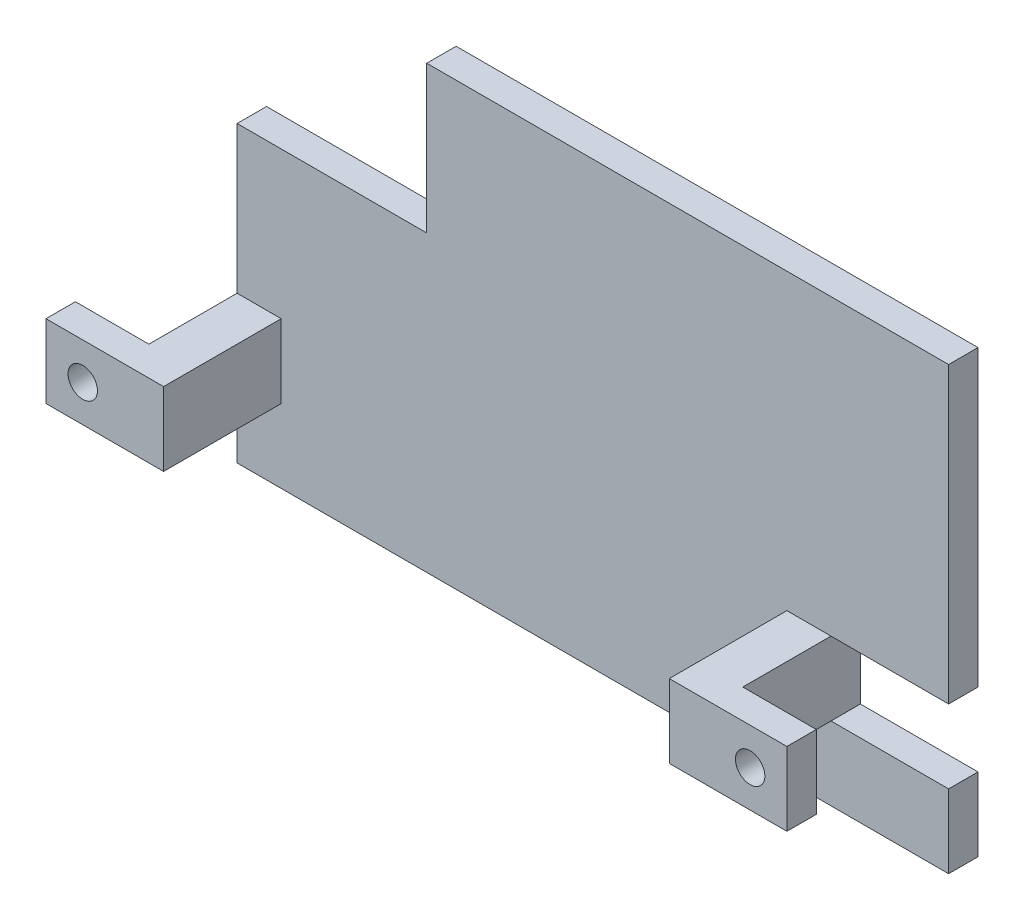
ISO-10303-21;
HEADER;
FILE_DESCRIPTION(('STEP AP214'),'2;1');
FILE_NAME('part.step','',(''),(''),'','','');
FILE_SCHEMA(('AUTOMOTIVE_DESIGN { 1 0 10303 214 1 1 1 1 }'));
ENDSEC;
DATA;
#1=APPLICATION_CONTEXT('core data for automotive mechanical design processes');
#2=APPLICATION_PROTOCOL_DEFINITION('international standard','automotive_design',2000,#1);
#3=PRODUCT_CONTEXT('',#1,'mechanical');
#4=PRODUCT('Part','Part','',(#3));
#5=PRODUCT_RELATED_PRODUCT_CATEGORY('part','',(#4));
#6=PRODUCT_DEFINITION_FORMATION('','',#4);
#7=PRODUCT_DEFINITION_CONTEXT('part definition',#1,'design');
#8=PRODUCT_DEFINITION('design','',#6,#7);
#9=PRODUCT_DEFINITION_SHAPE('','',#8);
#10=(LENGTH_UNIT() NAMED_UNIT(*) SI_UNIT(.MILLI.,.METRE.));
#11=(NAMED_UNIT(*) PLANE_ANGLE_UNIT() SI_UNIT($,.RADIAN.));
#12=(NAMED_UNIT(*) SI_UNIT($,.STERADIAN.) SOLID_ANGLE_UNIT());
#13=UNCERTAINTY_MEASURE_WITH_UNIT(LENGTH_MEASURE(1.E-05),#10,'distance_accuracy_value','');
#14=(GEOMETRIC_REPRESENTATION_CONTEXT(3) GLOBAL_UNCERTAINTY_ASSIGNED_CONTEXT((#13)) GLOBAL_UNIT_ASSIGNED_CONTEXT((#10,
#11,#12)) REPRESENTATION_CONTEXT('',''));
#15=CARTESIAN_POINT('',(0.,0.,0.));
#16=DIRECTION('',(0.,0.,1.));
#17=DIRECTION('',(1.,0.,0.));
#18=AXIS2_PLACEMENT_3D('',#15,#16,#17);
#19=CARTESIAN_POINT('',(-0.387630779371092,-16.6710198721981,2.));
#20=DIRECTION('',(0.,0.,1.));
#21=DIRECTION('',(1.,0.,0.));
#22=AXIS2_PLACEMENT_3D('',#19,#20,#21);
#23=PLANE('',#22);
#24=DIRECTION('',(1.,0.,0.));
#25=VECTOR('',#24,1.);
#26=CARTESIAN_POINT('',(-0.387630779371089,3.32898012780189,2.));
#27=LINE('',#26,#25);
#28=CARTESIAN_POINT('',(-0.387630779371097,3.32898012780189,2.));
#29=VERTEX_POINT('',#28);
#30=CARTESIAN_POINT('',(12.5123692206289,3.32898012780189,2.));
#31=VERTEX_POINT('',#30);
#32=EDGE_CURVE('E202',#29,#31,#27,.T.);
#33=ORIENTED_EDGE('',*,*,#32,.F.);
#34=DIRECTION('',(0.,-1.,0.));
#35=VECTOR('',#34,1.);
#36=CARTESIAN_POINT('',(-0.387630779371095,13.3289801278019,2.));
#37=LINE('',#36,#35);
#38=CARTESIAN_POINT('',(-0.387630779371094,-6.67101987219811,2.));
#39=VERTEX_POINT('',#38);
#40=EDGE_CURVE('E53',#29,#39,#37,.T.);
#41=ORIENTED_EDGE('',*,*,#40,.T.);
#42=DIRECTION('',(-1.,0.,0.));
#43=VECTOR('',#42,1.);
#44=CARTESIAN_POINT('',(-0.387630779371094,-6.67101987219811,2.));
#45=LINE('',#44,#43);
#46=CARTESIAN_POINT('',(2.6123692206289,-6.67101987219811,2.));
#47=VERTEX_POINT('',#46);
#48=EDGE_CURVE('E323',#47,#39,#45,.T.);
#49=ORIENTED_EDGE('',*,*,#48,.F.);
#50=DIRECTION('',(0.,1.,0.));
#51=VECTOR('',#50,1.);
#52=CARTESIAN_POINT('',(2.6123692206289,-11.6710198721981,2.));
#53=LINE('',#52,#51);
#54=CARTESIAN_POINT('',(2.6123692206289,-11.6710198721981,2.));
#55=VERTEX_POINT('',#54);
#56=EDGE_CURVE('E311',#55,#47,#53,.T.);
#57=ORIENTED_EDGE('',*,*,#56,.F.);
#58=DIRECTION('',(1.,0.,0.));
#59=VECTOR('',#58,1.);
#60=CARTESIAN_POINT('',(-0.387630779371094,-11.6710198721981,2.));
#61=LINE('',#60,#59);
#62=CARTESIAN_POINT('',(-0.387630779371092,-11.6710198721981,2.));
#63=VERTEX_POINT('',#62);
#64=EDGE_CURVE('E316',#63,#55,#61,.T.);
#65=ORIENTED_EDGE('',*,*,#64,.F.);
#66=CARTESIAN_POINT('',(-0.387630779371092,-16.6710198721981,2.));
#67=VERTEX_POINT('',#66);
#68=EDGE_CURVE('E330',#63,#67,#37,.T.);
#69=ORIENTED_EDGE('',*,*,#68,.T.);
#70=DIRECTION('',(1.,0.,0.));
#71=VECTOR('',#70,1.);
#72=CARTESIAN_POINT('',(-0.387630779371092,-16.6710198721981,2.));
#73=LINE('',#72,#71);
#74=CARTESIAN_POINT('',(48.0123692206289,-16.6710198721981,2.));
#75=VERTEX_POINT('',#74);
#76=EDGE_CURVE('E356',#67,#75,#73,.T.);
#77=ORIENTED_EDGE('',*,*,#76,.T.);
#78=DIRECTION('',(0.,1.,0.));
#79=VECTOR('',#78,1.);
#80=CARTESIAN_POINT('',(48.0123692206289,13.3289801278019,2.));
#81=LINE('',#80,#79);
#82=CARTESIAN_POINT('',(48.0123692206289,-11.6710198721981,2.));
#83=VERTEX_POINT('',#82);
#84=EDGE_CURVE('E377',#75,#83,#81,.T.);
#85=ORIENTED_EDGE('',*,*,#84,.T.);
#86=DIRECTION('',(1.,0.,0.));
#87=VECTOR('',#86,1.);
#88=CARTESIAN_POINT('',(48.0123692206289,-11.6710198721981,2.));
#89=LINE('',#88,#87);
#90=CARTESIAN_POINT('',(40.0123692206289,-11.6710198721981,2.));
#91=VERTEX_POINT('',#90);
#92=EDGE_CURVE('E399',#91,#83,#89,.T.);
#93=ORIENTED_EDGE('',*,*,#92,.F.);
#94=DIRECTION('',(1.,0.,0.));
#95=VECTOR('',#94,1.);
#96=CARTESIAN_POINT('',(40.0123692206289,-11.6710198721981,2.));
#97=LINE('',#96,#95);
#98=CARTESIAN_POINT('',(37.0123692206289,-11.6710198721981,2.));
#99=VERTEX_POINT('',#98);
#100=EDGE_CURVE('E292',#99,#91,#97,.T.);
#101=ORIENTED_EDGE('',*,*,#100,.F.);
#102=DIRECTION('',(0.,-1.,0.));
#103=VECTOR('',#102,1.);
#104=CARTESIAN_POINT('',(37.0123692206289,-6.67101987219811,2.));
#105=LINE('',#104,#103);
#106=CARTESIAN_POINT('',(37.0123692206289,-6.67101987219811,2.));
#107=VERTEX_POINT('',#106);
#108=EDGE_CURVE('E299',#107,#99,#105,.T.);
#109=ORIENTED_EDGE('',*,*,#108,.F.);
#110=DIRECTION('',(-1.,0.,0.));
#111=VECTOR('',#110,1.);
#112=CARTESIAN_POINT('',(40.0123692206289,-6.67101987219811,2.));
#113=LINE('',#112,#111);
#114=CARTESIAN_POINT('',(40.0123692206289,-6.67101987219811,2.));
#115=VERTEX_POINT('',#114);
#116=EDGE_CURVE('E284',#115,#107,#113,.T.);
#117=ORIENTED_EDGE('',*,*,#116,.F.);
#118=DIRECTION('',(-1.,0.,0.));
#119=VECTOR('',#118,1.);
#120=CARTESIAN_POINT('',(40.0123692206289,-6.67101987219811,2.));
#121=LINE('',#120,#119);
#122=CARTESIAN_POINT('',(48.0123692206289,-6.67101987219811,2.));
#123=VERTEX_POINT('',#122);
#124=EDGE_CURVE('E396',#123,#115,#121,.T.);
#125=ORIENTED_EDGE('',*,*,#124,.F.);
#126=CARTESIAN_POINT('',(48.0123692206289,13.3289801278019,2.));
#127=VERTEX_POINT('',#126);
#128=EDGE_CURVE('E410',#123,#127,#81,.T.);
#129=ORIENTED_EDGE('',*,*,#128,.T.);
#130=DIRECTION('',(-1.,0.,0.));
#131=VECTOR('',#130,1.);
#132=CARTESIAN_POINT('',(-0.387630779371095,13.3289801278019,2.));
#133=LINE('',#132,#131);
#134=CARTESIAN_POINT('',(12.5123692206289,13.3289801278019,2.));
#135=VERTEX_POINT('',#134);
#136=EDGE_CURVE('E368',#127,#135,#133,.T.);
#137=ORIENTED_EDGE('',*,*,#136,.T.);
#138=DIRECTION('',(0.,1.,0.));
#139=VECTOR('',#138,1.);
#140=CARTESIAN_POINT('',(12.5123692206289,-16.6710198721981,2.));
#141=LINE('',#140,#139);
#142=EDGE_CURVE('E219',#31,#135,#141,.T.);
#143=ORIENTED_EDGE('',*,*,#142,.F.);
#144=EDGE_LOOP('',(#33,#41,#49,#57,#65,#69,#77,#85,#93,#101,#109,#117,#125,#129,#137,#143));
#145=FACE_BOUND('',#144,.T.);
#146=ADVANCED_FACE('F49',(#145),#23,.T.);
#147=CARTESIAN_POINT('',(48.0123692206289,13.3289801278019,2.));
#148=DIRECTION('',(-1.,0.,0.));
#149=DIRECTION('',(0.,-1.,0.));
#150=AXIS2_PLACEMENT_3D('',#147,#148,#149);
#151=PLANE('',#150);
#152=DIRECTION('',(0.,1.,0.));
#153=VECTOR('',#152,1.);
#154=CARTESIAN_POINT('',(48.0123692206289,13.3289801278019,0.));
#155=LINE('',#154,#153);
#156=CARTESIAN_POINT('',(48.0123692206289,-16.6710198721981,0.));
#157=VERTEX_POINT('',#156);
#158=CARTESIAN_POINT('',(48.0123692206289,-11.6710198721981,0.));
#159=VERTEX_POINT('',#158);
#160=EDGE_CURVE('E357',#157,#159,#155,.T.);
#161=ORIENTED_EDGE('',*,*,#160,.T.);
#162=DIRECTION('',(0.,0.,1.));
#163=VECTOR('',#162,1.);
#164=CARTESIAN_POINT('',(48.0123692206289,-11.6710198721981,0.));
#165=LINE('',#164,#163);
#166=EDGE_CURVE('E401',#159,#83,#165,.T.);
#167=ORIENTED_EDGE('',*,*,#166,.T.);
#168=ORIENTED_EDGE('',*,*,#84,.F.);
#169=DIRECTION('',(0.,0.,-1.));
#170=VECTOR('',#169,1.);
#171=CARTESIAN_POINT('',(48.0123692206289,-16.6710198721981,2.));
#172=LINE('',#171,#170);
#173=EDGE_CURVE('E59',#75,#157,#172,.T.);
#174=ORIENTED_EDGE('',*,*,#173,.T.);
#175=EDGE_LOOP('',(#161,#167,#168,#174));
#176=FACE_BOUND('',#175,.T.);
#177=ADVANCED_FACE('F374',(#176),#151,.F.);
#178=CARTESIAN_POINT('',(-0.387630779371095,13.3289801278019,2.));
#179=DIRECTION('',(1.,0.,0.));
#180=DIRECTION('',(0.,1.,0.));
#181=AXIS2_PLACEMENT_3D('',#178,#179,#180);
#182=PLANE('',#181);
#183=ORIENTED_EDGE('',*,*,#40,.F.);
#184=DIRECTION('',(0.,0.,-1.));
#185=VECTOR('',#184,1.);
#186=CARTESIAN_POINT('',(-0.387630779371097,3.32898012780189,10.));
#187=LINE('',#186,#185);
#188=CARTESIAN_POINT('',(-0.387630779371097,3.32898012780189,0.));
#189=VERTEX_POINT('',#188);
#190=EDGE_CURVE('E204',#29,#189,#187,.T.);
#191=ORIENTED_EDGE('',*,*,#190,.T.);
#192=DIRECTION('',(0.,-1.,0.));
#193=VECTOR('',#192,1.);
#194=CARTESIAN_POINT('',(-0.387630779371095,13.3289801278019,0.));
#195=LINE('',#194,#193);
#196=CARTESIAN_POINT('',(-0.387630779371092,-16.6710198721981,0.));
#197=VERTEX_POINT('',#196);
#198=EDGE_CURVE('E215',#189,#197,#195,.T.);
#199=ORIENTED_EDGE('',*,*,#198,.T.);
#200=DIRECTION('',(0.,0.,-1.));
#201=VECTOR('',#200,1.);
#202=CARTESIAN_POINT('',(-0.387630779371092,-16.6710198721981,2.));
#203=LINE('',#202,#201);
#204=EDGE_CURVE('E12',#67,#197,#203,.T.);
#205=ORIENTED_EDGE('',*,*,#204,.F.);
#206=ORIENTED_EDGE('',*,*,#68,.F.);
#207=DIRECTION('',(0.,0.,-1.));
#208=VECTOR('',#207,1.);
#209=CARTESIAN_POINT('',(-0.387630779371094,-11.6710198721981,10.));
#210=LINE('',#209,#208);
#211=CARTESIAN_POINT('',(-0.387630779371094,-11.6710198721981,8.));
#212=VERTEX_POINT('',#211);
#213=EDGE_CURVE('E338',#212,#63,#210,.T.);
#214=ORIENTED_EDGE('',*,*,#213,.F.);
#215=DIRECTION('',(0.,1.,0.));
#216=VECTOR('',#215,1.);
#217=CARTESIAN_POINT('',(-0.387630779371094,-11.6710198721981,8.));
#218=LINE('',#217,#216);
#219=CARTESIAN_POINT('',(-0.387630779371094,-6.67101987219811,8.));
#220=VERTEX_POINT('',#219);
#221=EDGE_CURVE('E262',#212,#220,#218,.T.);
#222=ORIENTED_EDGE('',*,*,#221,.T.);
#223=DIRECTION('',(0.,0.,-1.));
#224=VECTOR('',#223,1.);
#225=CARTESIAN_POINT('',(-0.387630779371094,-6.67101987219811,10.));
#226=LINE('',#225,#224);
#227=EDGE_CURVE('E266',#220,#39,#226,.T.);
#228=ORIENTED_EDGE('',*,*,#227,.T.);
#229=EDGE_LOOP('',(#183,#191,#199,#205,#206,#214,#222,#228));
#230=FACE_BOUND('',#229,.T.);
#231=ADVANCED_FACE('F51',(#230),#182,.F.);
#232=CARTESIAN_POINT('',(-0.387630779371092,-16.6710198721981,2.));
#233=DIRECTION('',(0.,1.,0.));
#234=DIRECTION('',(0.,0.,1.));
#235=AXIS2_PLACEMENT_3D('',#232,#233,#234);
#236=PLANE('',#235);
#237=DIRECTION('',(1.,0.,0.));
#238=VECTOR('',#237,1.);
#239=CARTESIAN_POINT('',(-0.387630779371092,-16.6710198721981,0.));
#240=LINE('',#239,#238);
#241=EDGE_CURVE('E380',#197,#157,#240,.T.);
#242=ORIENTED_EDGE('',*,*,#241,.T.);
#243=ORIENTED_EDGE('',*,*,#173,.F.);
#244=ORIENTED_EDGE('',*,*,#76,.F.);
#245=ORIENTED_EDGE('',*,*,#204,.T.);
#246=EDGE_LOOP('',(#242,#243,#244,#245));
#247=FACE_BOUND('',#246,.T.);
#248=ADVANCED_FACE('F470',(#247),#236,.F.);
#249=ORIENTED_EDGE('',*,*,#128,.F.);
#250=DIRECTION('',(0.,0.,1.));
#251=VECTOR('',#250,1.);
#252=CARTESIAN_POINT('',(48.0123692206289,-6.67101987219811,0.));
#253=LINE('',#252,#251);
#254=CARTESIAN_POINT('',(48.0123692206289,-6.67101987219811,0.));
#255=VERTEX_POINT('',#254);
#256=EDGE_CURVE('E388',#255,#123,#253,.T.);
#257=ORIENTED_EDGE('',*,*,#256,.F.);
#258=CARTESIAN_POINT('',(48.0123692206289,13.3289801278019,0.));
#259=VERTEX_POINT('',#258);
#260=EDGE_CURVE('E362',#255,#259,#155,.T.);
#261=ORIENTED_EDGE('',*,*,#260,.T.);
#262=DIRECTION('',(0.,0.,-1.));
#263=VECTOR('',#262,1.);
#264=CARTESIAN_POINT('',(48.0123692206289,13.3289801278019,2.));
#265=LINE('',#264,#263);
#266=EDGE_CURVE('E366',#127,#259,#265,.T.);
#267=ORIENTED_EDGE('',*,*,#266,.F.);
#268=EDGE_LOOP('',(#249,#257,#261,#267));
#269=FACE_BOUND('',#268,.T.);
#270=ADVANCED_FACE('F419',(#269),#151,.F.);
#271=CARTESIAN_POINT('',(-0.387630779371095,13.3289801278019,2.));
#272=DIRECTION('',(0.,-1.,0.));
#273=DIRECTION('',(0.,0.,-1.));
#274=AXIS2_PLACEMENT_3D('',#271,#272,#273);
#275=PLANE('',#274);
#276=DIRECTION('',(-1.,0.,0.));
#277=VECTOR('',#276,1.);
#278=CARTESIAN_POINT('',(-0.387630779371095,13.3289801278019,0.));
#279=LINE('',#278,#277);
#280=CARTESIAN_POINT('',(12.5123692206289,13.3289801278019,0.));
#281=VERTEX_POINT('',#280);
#282=EDGE_CURVE('E355',#259,#281,#279,.T.);
#283=ORIENTED_EDGE('',*,*,#282,.T.);
#284=DIRECTION('',(0.,0.,-1.));
#285=VECTOR('',#284,1.);
#286=CARTESIAN_POINT('',(12.5123692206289,13.3289801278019,10.));
#287=LINE('',#286,#285);
#288=EDGE_CURVE('E67',#135,#281,#287,.T.);
#289=ORIENTED_EDGE('',*,*,#288,.F.);
#290=ORIENTED_EDGE('',*,*,#136,.F.);
#291=ORIENTED_EDGE('',*,*,#266,.T.);
#292=EDGE_LOOP('',(#283,#289,#290,#291));
#293=FACE_BOUND('',#292,.T.);
#294=ADVANCED_FACE('F421',(#293),#275,.F.);
#295=CARTESIAN_POINT('',(-0.387630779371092,-16.6710198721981,0.));
#296=DIRECTION('',(0.,0.,1.));
#297=DIRECTION('',(1.,0.,0.));
#298=AXIS2_PLACEMENT_3D('',#295,#296,#297);
#299=PLANE('',#298);
#300=ORIENTED_EDGE('',*,*,#198,.F.);
#301=DIRECTION('',(-1.,0.,0.));
#302=VECTOR('',#301,1.);
#303=CARTESIAN_POINT('',(-0.387630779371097,3.32898012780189,0.));
#304=LINE('',#303,#302);
#305=CARTESIAN_POINT('',(12.5123692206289,3.32898012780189,0.));
#306=VERTEX_POINT('',#305);
#307=EDGE_CURVE('E199',#306,#189,#304,.T.);
#308=ORIENTED_EDGE('',*,*,#307,.F.);
#309=DIRECTION('',(0.,-1.,0.));
#310=VECTOR('',#309,1.);
#311=CARTESIAN_POINT('',(12.5123692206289,13.3289801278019,0.));
#312=LINE('',#311,#310);
#313=EDGE_CURVE('E206',#281,#306,#312,.T.);
#314=ORIENTED_EDGE('',*,*,#313,.F.);
#315=ORIENTED_EDGE('',*,*,#282,.F.);
#316=ORIENTED_EDGE('',*,*,#260,.F.);
#317=DIRECTION('',(-1.,0.,0.));
#318=VECTOR('',#317,1.);
#319=CARTESIAN_POINT('',(40.0123692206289,-6.67101987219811,0.));
#320=LINE('',#319,#318);
#321=CARTESIAN_POINT('',(40.0123692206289,-6.67101987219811,0.));
#322=VERTEX_POINT('',#321);
#323=EDGE_CURVE('E392',#255,#322,#320,.T.);
#324=ORIENTED_EDGE('',*,*,#323,.T.);
#325=DIRECTION('',(0.,-1.,0.));
#326=VECTOR('',#325,1.);
#327=CARTESIAN_POINT('',(40.0123692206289,-11.6710198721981,0.));
#328=LINE('',#327,#326);
#329=CARTESIAN_POINT('',(40.0123692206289,-11.6710198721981,0.));
#330=VERTEX_POINT('',#329);
#331=EDGE_CURVE('E385',#322,#330,#328,.T.);
#332=ORIENTED_EDGE('',*,*,#331,.T.);
#333=DIRECTION('',(1.,0.,0.));
#334=VECTOR('',#333,1.);
#335=CARTESIAN_POINT('',(48.0123692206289,-11.6710198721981,0.));
#336=LINE('',#335,#334);
#337=EDGE_CURVE('E383',#330,#159,#336,.T.);
#338=ORIENTED_EDGE('',*,*,#337,.T.);
#339=ORIENTED_EDGE('',*,*,#160,.F.);
#340=ORIENTED_EDGE('',*,*,#241,.F.);
#341=EDGE_LOOP('',(#300,#308,#314,#315,#316,#324,#332,#338,#339,#340));
#342=FACE_BOUND('',#341,.T.);
#343=ADVANCED_FACE('F213',(#342),#299,.F.);
#344=CARTESIAN_POINT('',(48.0123692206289,-11.6710198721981,0.));
#345=DIRECTION('',(0.,-1.,0.));
#346=DIRECTION('',(0.,0.,-1.));
#347=AXIS2_PLACEMENT_3D('',#344,#345,#346);
#348=PLANE('',#347);
#349=ORIENTED_EDGE('',*,*,#92,.T.);
#350=ORIENTED_EDGE('',*,*,#166,.F.);
#351=ORIENTED_EDGE('',*,*,#337,.F.);
#352=DIRECTION('',(0.,0.,1.));
#353=VECTOR('',#352,1.);
#354=CARTESIAN_POINT('',(40.0123692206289,-11.6710198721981,0.));
#355=LINE('',#354,#353);
#356=EDGE_CURVE('E403',#330,#91,#355,.T.);
#357=ORIENTED_EDGE('',*,*,#356,.T.);
#358=EDGE_LOOP('',(#349,#350,#351,#357));
#359=FACE_BOUND('',#358,.T.);
#360=ADVANCED_FACE('F467',(#359),#348,.F.);
#361=CARTESIAN_POINT('',(40.0123692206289,-11.6710198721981,0.));
#362=DIRECTION('',(-1.,0.,0.));
#363=DIRECTION('',(0.,0.,1.));
#364=AXIS2_PLACEMENT_3D('',#361,#362,#363);
#365=PLANE('',#364);
#366=DIRECTION('',(0.,0.,-1.));
#367=VECTOR('',#366,1.);
#368=CARTESIAN_POINT('',(40.0123692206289,-6.67101987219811,10.));
#369=LINE('',#368,#367);
#370=CARTESIAN_POINT('',(40.0123692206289,-6.67101987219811,8.));
#371=VERTEX_POINT('',#370);
#372=EDGE_CURVE('E296',#371,#115,#369,.T.);
#373=ORIENTED_EDGE('',*,*,#372,.F.);
#374=DIRECTION('',(0.,-1.,0.));
#375=VECTOR('',#374,1.);
#376=CARTESIAN_POINT('',(40.0123692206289,-6.67101987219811,8.));
#377=LINE('',#376,#375);
#378=CARTESIAN_POINT('',(40.0123692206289,-11.6710198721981,8.));
#379=VERTEX_POINT('',#378);
#380=EDGE_CURVE('E233',#371,#379,#377,.T.);
#381=ORIENTED_EDGE('',*,*,#380,.T.);
#382=DIRECTION('',(0.,0.,-1.));
#383=VECTOR('',#382,1.);
#384=CARTESIAN_POINT('',(40.0123692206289,-11.6710198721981,10.));
#385=LINE('',#384,#383);
#386=EDGE_CURVE('E304',#379,#91,#385,.T.);
#387=ORIENTED_EDGE('',*,*,#386,.T.);
#388=ORIENTED_EDGE('',*,*,#356,.F.);
#389=ORIENTED_EDGE('',*,*,#331,.F.);
#390=DIRECTION('',(0.,0.,1.));
#391=VECTOR('',#390,1.);
#392=CARTESIAN_POINT('',(40.0123692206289,-6.67101987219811,0.));
#393=LINE('',#392,#391);
#394=EDGE_CURVE('E390',#322,#115,#393,.T.);
#395=ORIENTED_EDGE('',*,*,#394,.T.);
#396=EDGE_LOOP('',(#373,#381,#387,#388,#389,#395));
#397=FACE_BOUND('',#396,.T.);
#398=ADVANCED_FACE('F501',(#397),#365,.F.);
#399=CARTESIAN_POINT('',(40.0123692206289,-6.67101987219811,0.));
#400=DIRECTION('',(0.,1.,0.));
#401=DIRECTION('',(0.,0.,1.));
#402=AXIS2_PLACEMENT_3D('',#399,#400,#401);
#403=PLANE('',#402);
#404=ORIENTED_EDGE('',*,*,#124,.T.);
#405=ORIENTED_EDGE('',*,*,#394,.F.);
#406=ORIENTED_EDGE('',*,*,#323,.F.);
#407=ORIENTED_EDGE('',*,*,#256,.T.);
#408=EDGE_LOOP('',(#404,#405,#406,#407));
#409=FACE_BOUND('',#408,.T.);
#410=ADVANCED_FACE('F427',(#409),#403,.F.);
#411=CARTESIAN_POINT('',(2.6123692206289,-11.6710198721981,10.));
#412=DIRECTION('',(-1.,0.,0.));
#413=DIRECTION('',(0.,0.,1.));
#414=AXIS2_PLACEMENT_3D('',#411,#412,#413);
#415=PLANE('',#414);
#416=ORIENTED_EDGE('',*,*,#56,.T.);
#417=DIRECTION('',(0.,0.,-1.));
#418=VECTOR('',#417,1.);
#419=CARTESIAN_POINT('',(2.6123692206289,-6.67101987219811,10.));
#420=LINE('',#419,#418);
#421=CARTESIAN_POINT('',(2.6123692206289,-6.67101987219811,10.));
#422=VERTEX_POINT('',#421);
#423=EDGE_CURVE('E341',#422,#47,#420,.T.);
#424=ORIENTED_EDGE('',*,*,#423,.F.);
#425=DIRECTION('',(0.,1.,0.));
#426=VECTOR('',#425,1.);
#427=CARTESIAN_POINT('',(2.6123692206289,-11.6710198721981,10.));
#428=LINE('',#427,#426);
#429=CARTESIAN_POINT('',(2.6123692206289,-11.6710198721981,10.));
#430=VERTEX_POINT('',#429);
#431=EDGE_CURVE('E312',#430,#422,#428,.T.);
#432=ORIENTED_EDGE('',*,*,#431,.F.);
#433=DIRECTION('',(0.,0.,-1.));
#434=VECTOR('',#433,1.);
#435=CARTESIAN_POINT('',(2.6123692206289,-11.6710198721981,10.));
#436=LINE('',#435,#434);
#437=EDGE_CURVE('E320',#430,#55,#436,.T.);
#438=ORIENTED_EDGE('',*,*,#437,.T.);
#439=EDGE_LOOP('',(#416,#424,#432,#438));
#440=FACE_BOUND('',#439,.T.);
#441=ADVANCED_FACE('F346',(#440),#415,.F.);
#442=CARTESIAN_POINT('',(-0.387630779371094,-6.67101987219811,10.));
#443=DIRECTION('',(0.,-1.,0.));
#444=DIRECTION('',(0.,0.,-1.));
#445=AXIS2_PLACEMENT_3D('',#442,#443,#444);
#446=PLANE('',#445);
#447=ORIENTED_EDGE('',*,*,#48,.T.);
#448=ORIENTED_EDGE('',*,*,#227,.F.);
#449=DIRECTION('',(-1.,0.,0.));
#450=VECTOR('',#449,1.);
#451=CARTESIAN_POINT('',(-0.387630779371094,-6.67101987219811,8.));
#452=LINE('',#451,#450);
#453=CARTESIAN_POINT('',(-5.38763077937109,-6.67101987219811,8.));
#454=VERTEX_POINT('',#453);
#455=EDGE_CURVE('E75',#220,#454,#452,.T.);
#456=ORIENTED_EDGE('',*,*,#455,.T.);
#457=DIRECTION('',(0.,0.,1.));
#458=VECTOR('',#457,1.);
#459=CARTESIAN_POINT('',(-5.38763077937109,-6.67101987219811,8.));
#460=LINE('',#459,#458);
#461=CARTESIAN_POINT('',(-5.38763077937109,-6.67101987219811,10.));
#462=VERTEX_POINT('',#461);
#463=EDGE_CURVE('E285',#454,#462,#460,.T.);
#464=ORIENTED_EDGE('',*,*,#463,.T.);
#465=DIRECTION('',(-1.,0.,0.));
#466=VECTOR('',#465,1.);
#467=CARTESIAN_POINT('',(-0.387630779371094,-6.67101987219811,10.));
#468=LINE('',#467,#466);
#469=EDGE_CURVE('E315',#422,#462,#468,.T.);
#470=ORIENTED_EDGE('',*,*,#469,.F.);
#471=ORIENTED_EDGE('',*,*,#423,.T.);
#472=EDGE_LOOP('',(#447,#448,#456,#464,#470,#471));
#473=FACE_BOUND('',#472,.T.);
#474=ADVANCED_FACE('F430',(#473),#446,.F.);
#475=CARTESIAN_POINT('',(-0.387630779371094,-11.6710198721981,10.));
#476=DIRECTION('',(0.,1.,0.));
#477=DIRECTION('',(0.,0.,1.));
#478=AXIS2_PLACEMENT_3D('',#475,#476,#477);
#479=PLANE('',#478);
#480=ORIENTED_EDGE('',*,*,#64,.T.);
#481=ORIENTED_EDGE('',*,*,#437,.F.);
#482=DIRECTION('',(1.,0.,0.));
#483=VECTOR('',#482,1.);
#484=CARTESIAN_POINT('',(-0.387630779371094,-11.6710198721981,10.));
#485=LINE('',#484,#483);
#486=CARTESIAN_POINT('',(-5.38763077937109,-11.6710198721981,10.));
#487=VERTEX_POINT('',#486);
#488=EDGE_CURVE('E318',#487,#430,#485,.T.);
#489=ORIENTED_EDGE('',*,*,#488,.F.);
#490=DIRECTION('',(0.,0.,1.));
#491=VECTOR('',#490,1.);
#492=CARTESIAN_POINT('',(-5.38763077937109,-11.6710198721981,8.));
#493=LINE('',#492,#491);
#494=CARTESIAN_POINT('',(-5.38763077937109,-11.6710198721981,8.));
#495=VERTEX_POINT('',#494);
#496=EDGE_CURVE('E281',#495,#487,#493,.T.);
#497=ORIENTED_EDGE('',*,*,#496,.F.);
#498=DIRECTION('',(1.,0.,0.));
#499=VECTOR('',#498,1.);
#500=CARTESIAN_POINT('',(-0.387630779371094,-11.6710198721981,8.));
#501=LINE('',#500,#499);
#502=EDGE_CURVE('E265',#495,#212,#501,.T.);
#503=ORIENTED_EDGE('',*,*,#502,.T.);
#504=ORIENTED_EDGE('',*,*,#213,.T.);
#505=EDGE_LOOP('',(#480,#481,#489,#497,#503,#504));
#506=FACE_BOUND('',#505,.T.);
#507=ADVANCED_FACE('F348',(#506),#479,.F.);
#508=CARTESIAN_POINT('',(2.6123692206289,-6.67101987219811,10.));
#509=DIRECTION('',(0.,0.,-1.));
#510=DIRECTION('',(-1.,0.,0.));
#511=AXIS2_PLACEMENT_3D('',#508,#509,#510);
#512=PLANE('',#511);
#513=ORIENTED_EDGE('',*,*,#431,.T.);
#514=ORIENTED_EDGE('',*,*,#469,.T.);
#515=DIRECTION('',(0.,-1.,0.));
#516=VECTOR('',#515,1.);
#517=CARTESIAN_POINT('',(-5.38763077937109,-11.6710198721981,10.));
#518=LINE('',#517,#516);
#519=EDGE_CURVE('E254',#462,#487,#518,.T.);
#520=ORIENTED_EDGE('',*,*,#519,.T.);
#521=ORIENTED_EDGE('',*,*,#488,.T.);
#522=EDGE_LOOP('',(#513,#514,#520,#521));
#523=FACE_BOUND('',#522,.T.);
#524=CARTESIAN_POINT('',(-2.88763077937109,-9.17101987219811,10.));
#525=DIRECTION('',(0.,0.,1.));
#526=DIRECTION('',(1.,0.,0.));
#527=AXIS2_PLACEMENT_3D('',#524,#525,#526);
#528=CIRCLE('',#527,1.);
#529=CARTESIAN_POINT('',(-1.88763077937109,-9.17101987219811,10.));
#530=VERTEX_POINT('',#529);
#531=EDGE_CURVE('E248',#530,#530,#528,.T.);
#532=ORIENTED_EDGE('',*,*,#531,.F.);
#533=EDGE_LOOP('',(#532));
#534=FACE_BOUND('',#533,.T.);
#535=ADVANCED_FACE('F432',(#523,#534),#512,.F.);
#536=CARTESIAN_POINT('',(40.0123692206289,-6.67101987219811,10.));
#537=DIRECTION('',(0.,-1.,0.));
#538=DIRECTION('',(1.,0.,0.));
#539=AXIS2_PLACEMENT_3D('',#536,#537,#538);
#540=PLANE('',#539);
#541=ORIENTED_EDGE('',*,*,#116,.T.);
#542=DIRECTION('',(0.,0.,-1.));
#543=VECTOR('',#542,1.);
#544=CARTESIAN_POINT('',(37.0123692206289,-6.67101987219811,10.));
#545=LINE('',#544,#543);
#546=CARTESIAN_POINT('',(37.0123692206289,-6.67101987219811,10.));
#547=VERTEX_POINT('',#546);
#548=EDGE_CURVE('E309',#547,#107,#545,.T.);
#549=ORIENTED_EDGE('',*,*,#548,.F.);
#550=DIRECTION('',(-1.,0.,0.));
#551=VECTOR('',#550,1.);
#552=CARTESIAN_POINT('',(40.0123692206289,-6.67101987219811,10.));
#553=LINE('',#552,#551);
#554=CARTESIAN_POINT('',(45.0123692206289,-6.67101987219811,10.));
#555=VERTEX_POINT('',#554);
#556=EDGE_CURVE('E288',#555,#547,#553,.T.);
#557=ORIENTED_EDGE('',*,*,#556,.F.);
#558=DIRECTION('',(0.,0.,1.));
#559=VECTOR('',#558,1.);
#560=CARTESIAN_POINT('',(45.0123692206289,-6.67101987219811,8.));
#561=LINE('',#560,#559);
#562=CARTESIAN_POINT('',(45.0123692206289,-6.67101987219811,8.));
#563=VERTEX_POINT('',#562);
#564=EDGE_CURVE('E245',#563,#555,#561,.T.);
#565=ORIENTED_EDGE('',*,*,#564,.F.);
#566=DIRECTION('',(-1.,0.,0.));
#567=VECTOR('',#566,1.);
#568=CARTESIAN_POINT('',(40.0123692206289,-6.67101987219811,8.));
#569=LINE('',#568,#567);
#570=EDGE_CURVE('E230',#563,#371,#569,.T.);
#571=ORIENTED_EDGE('',*,*,#570,.T.);
#572=ORIENTED_EDGE('',*,*,#372,.T.);
#573=EDGE_LOOP('',(#541,#549,#557,#565,#571,#572));
#574=FACE_BOUND('',#573,.T.);
#575=ADVANCED_FACE('F435',(#574),#540,.F.);
#576=CARTESIAN_POINT('',(37.0123692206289,-6.67101987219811,10.));
#577=DIRECTION('',(1.,0.,0.));
#578=DIRECTION('',(0.,0.,-1.));
#579=AXIS2_PLACEMENT_3D('',#576,#577,#578);
#580=PLANE('',#579);
#581=ORIENTED_EDGE('',*,*,#108,.T.);
#582=DIRECTION('',(0.,0.,-1.));
#583=VECTOR('',#582,1.);
#584=CARTESIAN_POINT('',(37.0123692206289,-11.6710198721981,10.));
#585=LINE('',#584,#583);
#586=CARTESIAN_POINT('',(37.0123692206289,-11.6710198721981,10.));
#587=VERTEX_POINT('',#586);
#588=EDGE_CURVE('E306',#587,#99,#585,.T.);
#589=ORIENTED_EDGE('',*,*,#588,.F.);
#590=DIRECTION('',(0.,-1.,0.));
#591=VECTOR('',#590,1.);
#592=CARTESIAN_POINT('',(37.0123692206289,-6.67101987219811,10.));
#593=LINE('',#592,#591);
#594=EDGE_CURVE('E291',#547,#587,#593,.T.);
#595=ORIENTED_EDGE('',*,*,#594,.F.);
#596=ORIENTED_EDGE('',*,*,#548,.T.);
#597=EDGE_LOOP('',(#581,#589,#595,#596));
#598=FACE_BOUND('',#597,.T.);
#599=ADVANCED_FACE('F527',(#598),#580,.F.);
#600=CARTESIAN_POINT('',(40.0123692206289,-11.6710198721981,10.));
#601=DIRECTION('',(0.,1.,0.));
#602=DIRECTION('',(-1.,0.,0.));
#603=AXIS2_PLACEMENT_3D('',#600,#601,#602);
#604=PLANE('',#603);
#605=ORIENTED_EDGE('',*,*,#100,.T.);
#606=ORIENTED_EDGE('',*,*,#386,.F.);
#607=DIRECTION('',(1.,0.,0.));
#608=VECTOR('',#607,1.);
#609=CARTESIAN_POINT('',(40.0123692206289,-11.6710198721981,8.));
#610=LINE('',#609,#608);
#611=CARTESIAN_POINT('',(45.0123692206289,-11.6710198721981,8.));
#612=VERTEX_POINT('',#611);
#613=EDGE_CURVE('E236',#379,#612,#610,.T.);
#614=ORIENTED_EDGE('',*,*,#613,.T.);
#615=DIRECTION('',(0.,0.,1.));
#616=VECTOR('',#615,1.);
#617=CARTESIAN_POINT('',(45.0123692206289,-11.6710198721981,8.));
#618=LINE('',#617,#616);
#619=CARTESIAN_POINT('',(45.0123692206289,-11.6710198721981,10.));
#620=VERTEX_POINT('',#619);
#621=EDGE_CURVE('E242',#612,#620,#618,.T.);
#622=ORIENTED_EDGE('',*,*,#621,.T.);
#623=DIRECTION('',(1.,0.,0.));
#624=VECTOR('',#623,1.);
#625=CARTESIAN_POINT('',(40.0123692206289,-11.6710198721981,10.));
#626=LINE('',#625,#624);
#627=EDGE_CURVE('E294',#587,#620,#626,.T.);
#628=ORIENTED_EDGE('',*,*,#627,.F.);
#629=ORIENTED_EDGE('',*,*,#588,.T.);
#630=EDGE_LOOP('',(#605,#606,#614,#622,#628,#629));
#631=FACE_BOUND('',#630,.T.);
#632=ADVANCED_FACE('F532',(#631),#604,.F.);
#633=CARTESIAN_POINT('',(37.0123692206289,-6.67101987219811,10.));
#634=DIRECTION('',(0.,0.,1.));
#635=DIRECTION('',(1.,0.,0.));
#636=AXIS2_PLACEMENT_3D('',#633,#634,#635);
#637=PLANE('',#636);
#638=ORIENTED_EDGE('',*,*,#556,.T.);
#639=ORIENTED_EDGE('',*,*,#594,.T.);
#640=ORIENTED_EDGE('',*,*,#627,.T.);
#641=DIRECTION('',(0.,1.,0.));
#642=VECTOR('',#641,1.);
#643=CARTESIAN_POINT('',(45.0123692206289,-6.67101987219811,10.));
#644=LINE('',#643,#642);
#645=EDGE_CURVE('E227',#620,#555,#644,.T.);
#646=ORIENTED_EDGE('',*,*,#645,.T.);
#647=EDGE_LOOP('',(#638,#639,#640,#646));
#648=FACE_BOUND('',#647,.T.);
#649=CARTESIAN_POINT('',(42.5123692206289,-9.17101987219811,10.));
#650=DIRECTION('',(0.,0.,1.));
#651=DIRECTION('',(1.,0.,0.));
#652=AXIS2_PLACEMENT_3D('',#649,#650,#651);
#653=CIRCLE('',#652,0.999999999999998);
#654=CARTESIAN_POINT('',(43.5123692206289,-9.17101987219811,10.));
#655=VERTEX_POINT('',#654);
#656=EDGE_CURVE('E223',#655,#655,#653,.T.);
#657=ORIENTED_EDGE('',*,*,#656,.F.);
#658=EDGE_LOOP('',(#657));
#659=FACE_BOUND('',#658,.T.);
#660=ADVANCED_FACE('F583',(#648,#659),#637,.T.);
#661=CARTESIAN_POINT('',(-5.38763077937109,-11.6710198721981,8.));
#662=DIRECTION('',(-1.,0.,0.));
#663=DIRECTION('',(0.,0.,1.));
#664=AXIS2_PLACEMENT_3D('',#661,#662,#663);
#665=PLANE('',#664);
#666=ORIENTED_EDGE('',*,*,#519,.F.);
#667=ORIENTED_EDGE('',*,*,#463,.F.);
#668=DIRECTION('',(0.,-1.,0.));
#669=VECTOR('',#668,1.);
#670=CARTESIAN_POINT('',(-5.38763077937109,-11.6710198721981,8.));
#671=LINE('',#670,#669);
#672=EDGE_CURVE('E259',#454,#495,#671,.T.);
#673=ORIENTED_EDGE('',*,*,#672,.T.);
#674=ORIENTED_EDGE('',*,*,#496,.T.);
#675=EDGE_LOOP('',(#666,#667,#673,#674));
#676=FACE_BOUND('',#675,.T.);
#677=ADVANCED_FACE('F452',(#676),#665,.T.);
#678=CARTESIAN_POINT('',(-5.38763077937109,-11.6710198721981,8.));
#679=DIRECTION('',(0.,0.,-1.));
#680=DIRECTION('',(-1.,0.,0.));
#681=AXIS2_PLACEMENT_3D('',#678,#679,#680);
#682=PLANE('',#681);
#683=CARTESIAN_POINT('',(-2.88763077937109,-9.17101987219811,8.));
#684=DIRECTION('',(0.,0.,1.));
#685=DIRECTION('',(1.,0.,0.));
#686=AXIS2_PLACEMENT_3D('',#683,#684,#685);
#687=CIRCLE('',#686,1.);
#688=CARTESIAN_POINT('',(-1.88763077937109,-9.17101987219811,8.));
#689=VERTEX_POINT('',#688);
#690=EDGE_CURVE('E251',#689,#689,#687,.T.);
#691=ORIENTED_EDGE('',*,*,#690,.T.);
#692=EDGE_LOOP('',(#691));
#693=FACE_BOUND('',#692,.T.);
#694=ORIENTED_EDGE('',*,*,#502,.F.);
#695=ORIENTED_EDGE('',*,*,#672,.F.);
#696=ORIENTED_EDGE('',*,*,#455,.F.);
#697=ORIENTED_EDGE('',*,*,#221,.F.);
#698=EDGE_LOOP('',(#694,#695,#696,#697));
#699=FACE_BOUND('',#698,.T.);
#700=ADVANCED_FACE('F442',(#693,#699),#682,.T.);
#701=CARTESIAN_POINT('',(-2.88763077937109,-9.17101987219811,8.));
#702=DIRECTION('',(0.,0.,1.));
#703=DIRECTION('',(1.,0.,0.));
#704=AXIS2_PLACEMENT_3D('',#701,#702,#703);
#705=CYLINDRICAL_SURFACE('',#704,1.);
#706=ORIENTED_EDGE('',*,*,#690,.F.);
#707=EDGE_LOOP('',(#706));
#708=FACE_BOUND('',#707,.T.);
#709=ORIENTED_EDGE('',*,*,#531,.T.);
#710=EDGE_LOOP('',(#709));
#711=FACE_BOUND('',#710,.T.);
#712=ADVANCED_FACE('F439',(#708,#711),#705,.F.);
#713=CARTESIAN_POINT('',(45.0123692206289,-6.67101987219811,8.));
#714=DIRECTION('',(1.,0.,0.));
#715=DIRECTION('',(0.,0.,-1.));
#716=AXIS2_PLACEMENT_3D('',#713,#714,#715);
#717=PLANE('',#716);
#718=ORIENTED_EDGE('',*,*,#645,.F.);
#719=ORIENTED_EDGE('',*,*,#621,.F.);
#720=DIRECTION('',(0.,1.,0.));
#721=VECTOR('',#720,1.);
#722=CARTESIAN_POINT('',(45.0123692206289,-6.67101987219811,8.));
#723=LINE('',#722,#721);
#724=EDGE_CURVE('E239',#612,#563,#723,.T.);
#725=ORIENTED_EDGE('',*,*,#724,.T.);
#726=ORIENTED_EDGE('',*,*,#564,.T.);
#727=EDGE_LOOP('',(#718,#719,#725,#726));
#728=FACE_BOUND('',#727,.T.);
#729=ADVANCED_FACE('F441',(#728),#717,.T.);
#730=CARTESIAN_POINT('',(45.0123692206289,-6.67101987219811,8.));
#731=DIRECTION('',(0.,0.,-1.));
#732=DIRECTION('',(-1.,0.,0.));
#733=AXIS2_PLACEMENT_3D('',#730,#731,#732);
#734=PLANE('',#733);
#735=CARTESIAN_POINT('',(42.5123692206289,-9.17101987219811,8.));
#736=DIRECTION('',(0.,0.,1.));
#737=DIRECTION('',(1.,0.,0.));
#738=AXIS2_PLACEMENT_3D('',#735,#736,#737);
#739=CIRCLE('',#738,0.999999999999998);
#740=CARTESIAN_POINT('',(43.5123692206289,-9.17101987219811,8.));
#741=VERTEX_POINT('',#740);
#742=EDGE_CURVE('E224',#741,#741,#739,.T.);
#743=ORIENTED_EDGE('',*,*,#742,.T.);
#744=EDGE_LOOP('',(#743));
#745=FACE_BOUND('',#744,.T.);
#746=ORIENTED_EDGE('',*,*,#570,.F.);
#747=ORIENTED_EDGE('',*,*,#724,.F.);
#748=ORIENTED_EDGE('',*,*,#613,.F.);
#749=ORIENTED_EDGE('',*,*,#380,.F.);
#750=EDGE_LOOP('',(#746,#747,#748,#749));
#751=FACE_BOUND('',#750,.T.);
#752=ADVANCED_FACE('F449',(#745,#751),#734,.T.);
#753=CARTESIAN_POINT('',(42.5123692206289,-9.17101987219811,8.));
#754=DIRECTION('',(0.,0.,1.));
#755=DIRECTION('',(1.,0.,0.));
#756=AXIS2_PLACEMENT_3D('',#753,#754,#755);
#757=CYLINDRICAL_SURFACE('',#756,0.999999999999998);
#758=ORIENTED_EDGE('',*,*,#742,.F.);
#759=EDGE_LOOP('',(#758));
#760=FACE_BOUND('',#759,.T.);
#761=ORIENTED_EDGE('',*,*,#656,.T.);
#762=EDGE_LOOP('',(#761));
#763=FACE_BOUND('',#762,.T.);
#764=ADVANCED_FACE('F627',(#760,#763),#757,.F.);
#765=CARTESIAN_POINT('',(-0.387630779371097,3.32898012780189,10.));
#766=DIRECTION('',(0.,-1.,0.));
#767=DIRECTION('',(1.,0.,0.));
#768=AXIS2_PLACEMENT_3D('',#765,#766,#767);
#769=PLANE('',#768);
#770=ORIENTED_EDGE('',*,*,#32,.T.);
#771=DIRECTION('',(0.,0.,-1.));
#772=VECTOR('',#771,1.);
#773=CARTESIAN_POINT('',(12.5123692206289,3.32898012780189,10.));
#774=LINE('',#773,#772);
#775=EDGE_CURVE('E196',#31,#306,#774,.T.);
#776=ORIENTED_EDGE('',*,*,#775,.T.);
#777=ORIENTED_EDGE('',*,*,#307,.T.);
#778=ORIENTED_EDGE('',*,*,#190,.F.);
#779=EDGE_LOOP('',(#770,#776,#777,#778));
#780=FACE_BOUND('',#779,.T.);
#781=ADVANCED_FACE('F197',(#780),#769,.F.);
#782=CARTESIAN_POINT('',(12.5123692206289,13.3289801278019,10.));
#783=DIRECTION('',(1.,0.,0.));
#784=DIRECTION('',(0.,0.,-1.));
#785=AXIS2_PLACEMENT_3D('',#782,#783,#784);
#786=PLANE('',#785);
#787=ORIENTED_EDGE('',*,*,#142,.T.);
#788=ORIENTED_EDGE('',*,*,#288,.T.);
#789=ORIENTED_EDGE('',*,*,#313,.T.);
#790=ORIENTED_EDGE('',*,*,#775,.F.);
#791=EDGE_LOOP('',(#787,#788,#789,#790));
#792=FACE_BOUND('',#791,.T.);
#793=ADVANCED_FACE('F207',(#792),#786,.F.);
#794=CLOSED_SHELL('',(#146,#177,#231,#248,#270,#294,#343,#360,#398,#410,#441,#474,#507,#535,
#575,#599,#632,#660,#677,#700,#712,#729,#752,#764,#781,#793));
#795=MANIFOLD_SOLID_BREP('B2',#794);
#796=ADVANCED_BREP_SHAPE_REPRESENTATION('',(#18,#795),#14);
#797=SHAPE_DEFINITION_REPRESENTATION(#9,#796);
ENDSEC;
END-ISO-10303-21;
